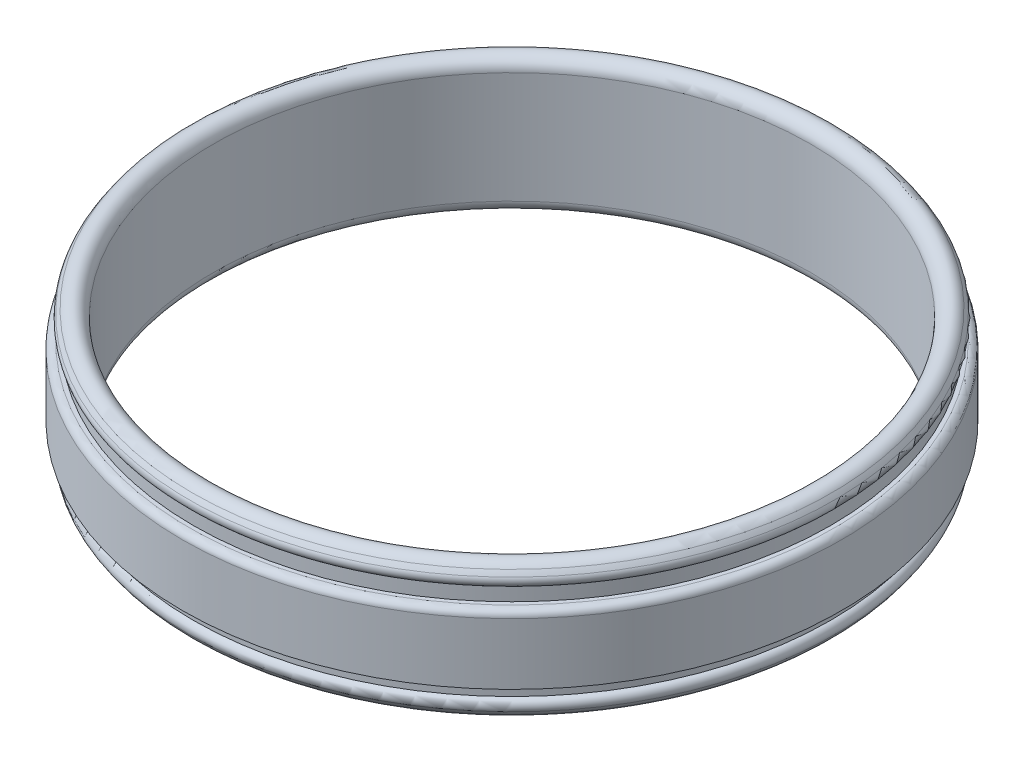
ISO-10303-21;
HEADER;
FILE_DESCRIPTION(('STEP AP214'),'2;1');
FILE_NAME('part.step','',(''),(''),'','','');
FILE_SCHEMA(('AUTOMOTIVE_DESIGN { 1 0 10303 214 1 1 1 1 }'));
ENDSEC;
DATA;
#1=APPLICATION_CONTEXT('core data for automotive mechanical design processes');
#2=APPLICATION_PROTOCOL_DEFINITION('international standard','automotive_design',2000,#1);
#3=PRODUCT_CONTEXT('',#1,'mechanical');
#4=PRODUCT('Part','Part','',(#3));
#5=PRODUCT_RELATED_PRODUCT_CATEGORY('part','',(#4));
#6=PRODUCT_DEFINITION_FORMATION('','',#4);
#7=PRODUCT_DEFINITION_CONTEXT('part definition',#1,'design');
#8=PRODUCT_DEFINITION('design','',#6,#7);
#9=PRODUCT_DEFINITION_SHAPE('','',#8);
#10=(LENGTH_UNIT() NAMED_UNIT(*) SI_UNIT(.MILLI.,.METRE.));
#11=(NAMED_UNIT(*) PLANE_ANGLE_UNIT() SI_UNIT($,.RADIAN.));
#12=(NAMED_UNIT(*) SI_UNIT($,.STERADIAN.) SOLID_ANGLE_UNIT());
#13=UNCERTAINTY_MEASURE_WITH_UNIT(LENGTH_MEASURE(1.E-05),#10,'distance_accuracy_value','');
#14=(GEOMETRIC_REPRESENTATION_CONTEXT(3) GLOBAL_UNCERTAINTY_ASSIGNED_CONTEXT((#13)) GLOBAL_UNIT_ASSIGNED_CONTEXT((#10,
#11,#12)) REPRESENTATION_CONTEXT('',''));
#15=CARTESIAN_POINT('',(0.,0.,0.));
#16=DIRECTION('',(0.,0.,1.));
#17=DIRECTION('',(1.,0.,0.));
#18=AXIS2_PLACEMENT_3D('',#15,#16,#17);
#19=CARTESIAN_POINT('',(0.,0.,0.));
#20=DIRECTION('',(0.,-1.,0.));
#21=DIRECTION('',(0.,0.,-1.));
#22=AXIS2_PLACEMENT_3D('',#19,#20,#21);
#23=CYLINDRICAL_SURFACE('',#22,64.5905314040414);
#24=CARTESIAN_POINT('',(0.,28.7992816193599,0.));
#25=DIRECTION('',(0.,1.,0.));
#26=DIRECTION('',(0.,0.,1.));
#27=AXIS2_PLACEMENT_3D('',#24,#25,#26);
#28=CIRCLE('',#27,64.5905314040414);
#29=CARTESIAN_POINT('',(0.,28.7992816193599,64.5905314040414));
#30=VERTEX_POINT('',#29);
#31=EDGE_CURVE('E56',#30,#30,#28,.T.);
#32=ORIENTED_EDGE('',*,*,#31,.T.);
#33=EDGE_LOOP('',(#32));
#34=FACE_BOUND('',#33,.T.);
#35=CARTESIAN_POINT('',(0.,4.76055773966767,0.));
#36=DIRECTION('',(0.,1.,0.));
#37=DIRECTION('',(0.,0.,1.));
#38=AXIS2_PLACEMENT_3D('',#35,#36,#37);
#39=CIRCLE('',#38,64.5905314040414);
#40=CARTESIAN_POINT('',(0.,4.76055773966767,64.5905314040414));
#41=VERTEX_POINT('',#40);
#42=EDGE_CURVE('E59',#41,#41,#39,.F.);
#43=ORIENTED_EDGE('',*,*,#42,.T.);
#44=EDGE_LOOP('',(#43));
#45=FACE_BOUND('',#44,.T.);
#46=ADVANCED_FACE('F33',(#34,#45),#23,.F.);
#47=CARTESIAN_POINT('',(0.,0.,0.));
#48=DIRECTION('',(0.,-1.,0.));
#49=DIRECTION('',(0.,0.,-1.));
#50=AXIS2_PLACEMENT_3D('',#47,#48,#49);
#51=CYLINDRICAL_SURFACE('',#50,71.2052243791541);
#52=CARTESIAN_POINT('',(0.,22.6502858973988,0.));
#53=DIRECTION('',(0.,-1.,0.));
#54=DIRECTION('',(0.,0.,-1.));
#55=AXIS2_PLACEMENT_3D('',#52,#53,#54);
#56=CIRCLE('',#55,71.2052243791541);
#57=CARTESIAN_POINT('',(0.,22.6502858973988,-71.2052243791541));
#58=VERTEX_POINT('',#57);
#59=EDGE_CURVE('E40',#58,#58,#56,.T.);
#60=ORIENTED_EDGE('',*,*,#59,.T.);
#61=EDGE_LOOP('',(#60));
#62=FACE_BOUND('',#61,.T.);
#63=CARTESIAN_POINT('',(0.,9.4095534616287,0.));
#64=DIRECTION('',(0.,1.,0.));
#65=DIRECTION('',(0.,0.,1.));
#66=AXIS2_PLACEMENT_3D('',#63,#64,#65);
#67=CIRCLE('',#66,71.2052243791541);
#68=CARTESIAN_POINT('',(0.,9.4095534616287,71.2052243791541));
#69=VERTEX_POINT('',#68);
#70=EDGE_CURVE('E71',#69,#69,#67,.F.);
#71=ORIENTED_EDGE('',*,*,#70,.F.);
#72=EDGE_LOOP('',(#71));
#73=FACE_BOUND('',#72,.T.);
#74=ADVANCED_FACE('F99',(#62,#73),#51,.T.);
#75=CARTESIAN_POINT('',(0.,9.4095534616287,0.));
#76=DIRECTION('',(0.,-1.,0.));
#77=DIRECTION('',(0.,0.,-1.));
#78=AXIS2_PLACEMENT_3D('',#75,#76,#77);
#79=TOROIDAL_SURFACE('',#78,61.2052243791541,10.);
#80=CARTESIAN_POINT('',(0.,4.18047288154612,0.));
#81=DIRECTION('',(0.,1.,0.));
#82=DIRECTION('',(0.,0.,1.));
#83=AXIS2_PLACEMENT_3D('',#80,#81,#82);
#84=CIRCLE('',#83,69.7291152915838);
#85=CARTESIAN_POINT('',(0.,4.18047288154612,69.7291152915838));
#86=VERTEX_POINT('',#85);
#87=EDGE_CURVE('E48',#86,#86,#84,.F.);
#88=ORIENTED_EDGE('',*,*,#87,.T.);
#89=EDGE_LOOP('',(#88));
#90=FACE_BOUND('',#89,.T.);
#91=CARTESIAN_POINT('',(0.,3.21089249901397,0.));
#92=DIRECTION('',(0.,1.,0.));
#93=DIRECTION('',(0.,0.,1.));
#94=AXIS2_PLACEMENT_3D('',#91,#92,#93);
#95=CIRCLE('',#94,69.0523004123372);
#96=CARTESIAN_POINT('',(0.,3.21089249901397,69.0523004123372));
#97=VERTEX_POINT('',#96);
#98=EDGE_CURVE('E53',#97,#97,#95,.T.);
#99=ORIENTED_EDGE('',*,*,#98,.T.);
#100=EDGE_LOOP('',(#99));
#101=FACE_BOUND('',#100,.T.);
#102=ADVANCED_FACE('F105',(#90,#101),#79,.T.);
#103=CARTESIAN_POINT('',(0.,24.1502858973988,0.));
#104=DIRECTION('',(0.,1.,0.));
#105=DIRECTION('',(0.,0.,1.));
#106=AXIS2_PLACEMENT_3D('',#103,#104,#105);
#107=TOROIDAL_SURFACE('',#106,61.2052243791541,10.);
#108=CARTESIAN_POINT('',(0.,29.3793664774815,0.));
#109=DIRECTION('',(0.,-1.,0.));
#110=DIRECTION('',(0.,0.,-1.));
#111=AXIS2_PLACEMENT_3D('',#108,#109,#110);
#112=CIRCLE('',#111,69.7291152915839);
#113=CARTESIAN_POINT('',(0.,29.3793664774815,-69.7291152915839));
#114=VERTEX_POINT('',#113);
#115=EDGE_CURVE('E10',#114,#114,#112,.F.);
#116=ORIENTED_EDGE('',*,*,#115,.T.);
#117=EDGE_LOOP('',(#116));
#118=FACE_BOUND('',#117,.T.);
#119=CARTESIAN_POINT('',(0.,30.3489468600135,0.));
#120=DIRECTION('',(0.,-1.,0.));
#121=DIRECTION('',(0.,0.,-1.));
#122=AXIS2_PLACEMENT_3D('',#119,#120,#121);
#123=CIRCLE('',#122,69.0523004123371);
#124=CARTESIAN_POINT('',(0.,30.3489468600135,-69.0523004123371));
#125=VERTEX_POINT('',#124);
#126=EDGE_CURVE('E62',#125,#125,#123,.T.);
#127=ORIENTED_EDGE('',*,*,#126,.T.);
#128=EDGE_LOOP('',(#127));
#129=FACE_BOUND('',#128,.T.);
#130=ADVANCED_FACE('F112',(#118,#129),#107,.T.);
#131=CARTESIAN_POINT('',(0.,28.7992816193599,0.));
#132=DIRECTION('',(0.,1.,0.));
#133=DIRECTION('',(0.,0.,1.));
#134=AXIS2_PLACEMENT_3D('',#131,#132,#133);
#135=TOROIDAL_SURFACE('',#134,67.0905314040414,2.5);
#136=ORIENTED_EDGE('',*,*,#31,.F.);
#137=EDGE_LOOP('',(#136));
#138=FACE_BOUND('',#137,.T.);
#139=ORIENTED_EDGE('',*,*,#126,.F.);
#140=EDGE_LOOP('',(#139));
#141=FACE_BOUND('',#140,.T.);
#142=ADVANCED_FACE('F116',(#138,#141),#135,.T.);
#143=CARTESIAN_POINT('',(0.,4.76055773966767,0.));
#144=DIRECTION('',(0.,1.,0.));
#145=DIRECTION('',(0.,0.,1.));
#146=AXIS2_PLACEMENT_3D('',#143,#144,#145);
#147=TOROIDAL_SURFACE('',#146,67.0905314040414,2.5);
#148=ORIENTED_EDGE('',*,*,#98,.F.);
#149=EDGE_LOOP('',(#148));
#150=FACE_BOUND('',#149,.T.);
#151=ORIENTED_EDGE('',*,*,#42,.F.);
#152=EDGE_LOOP('',(#151));
#153=FACE_BOUND('',#152,.T.);
#154=ADVANCED_FACE('F119',(#150,#153),#147,.T.);
#155=CARTESIAN_POINT('',(0.,0.,0.));
#156=DIRECTION('',(0.,-1.,0.));
#157=DIRECTION('',(0.,0.,-1.));
#158=AXIS2_PLACEMENT_3D('',#155,#156,#157);
#159=CYLINDRICAL_SURFACE('',#158,68.8540021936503);
#160=CARTESIAN_POINT('',(0.,24.1502858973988,0.));
#161=DIRECTION('',(0.,-1.,0.));
#162=DIRECTION('',(0.,0.,-1.));
#163=AXIS2_PLACEMENT_3D('',#160,#161,#162);
#164=CIRCLE('',#163,68.8540021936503);
#165=CARTESIAN_POINT('',(0.,24.1502858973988,-68.8540021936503));
#166=VERTEX_POINT('',#165);
#167=EDGE_CURVE('E68',#166,#166,#164,.T.);
#168=ORIENTED_EDGE('',*,*,#167,.F.);
#169=EDGE_LOOP('',(#168));
#170=FACE_BOUND('',#169,.T.);
#171=CARTESIAN_POINT('',(0.,27.1502858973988,0.));
#172=DIRECTION('',(0.,-1.,0.));
#173=DIRECTION('',(0.,0.,-1.));
#174=AXIS2_PLACEMENT_3D('',#171,#172,#173);
#175=CIRCLE('',#174,68.8540021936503);
#176=CARTESIAN_POINT('',(0.,27.1502858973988,-68.8540021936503));
#177=VERTEX_POINT('',#176);
#178=EDGE_CURVE('E65',#177,#177,#175,.T.);
#179=ORIENTED_EDGE('',*,*,#178,.T.);
#180=EDGE_LOOP('',(#179));
#181=FACE_BOUND('',#180,.T.);
#182=ADVANCED_FACE('F122',(#170,#181),#159,.T.);
#183=CARTESIAN_POINT('',(68.8540021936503,24.1502858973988,0.));
#184=DIRECTION('',(0.,-1.,0.));
#185=DIRECTION('',(0.,0.,-1.));
#186=AXIS2_PLACEMENT_3D('',#183,#184,#185);
#187=PLANE('',#186);
#188=CARTESIAN_POINT('',(0.,24.1502858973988,0.));
#189=DIRECTION('',(0.,-1.,0.));
#190=DIRECTION('',(0.,0.,-1.));
#191=AXIS2_PLACEMENT_3D('',#188,#189,#190);
#192=CIRCLE('',#191,69.7052243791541);
#193=CARTESIAN_POINT('',(0.,24.1502858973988,-69.7052243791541));
#194=VERTEX_POINT('',#193);
#195=EDGE_CURVE('E44',#194,#194,#192,.F.);
#196=ORIENTED_EDGE('',*,*,#195,.T.);
#197=EDGE_LOOP('',(#196));
#198=FACE_BOUND('',#197,.T.);
#199=ORIENTED_EDGE('',*,*,#167,.T.);
#200=EDGE_LOOP('',(#199));
#201=FACE_BOUND('',#200,.T.);
#202=ADVANCED_FACE('F95',(#198,#201),#187,.F.);
#203=CARTESIAN_POINT('',(0.,0.,0.));
#204=DIRECTION('',(0.,-1.,0.));
#205=DIRECTION('',(0.,0.,-1.));
#206=AXIS2_PLACEMENT_3D('',#203,#204,#205);
#207=CYLINDRICAL_SURFACE('',#206,68.8540021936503);
#208=CARTESIAN_POINT('',(0.,6.4095534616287,0.));
#209=DIRECTION('',(0.,-1.,0.));
#210=DIRECTION('',(0.,0.,-1.));
#211=AXIS2_PLACEMENT_3D('',#208,#209,#210);
#212=CIRCLE('',#211,68.8540021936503);
#213=CARTESIAN_POINT('',(0.,6.4095534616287,-68.8540021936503));
#214=VERTEX_POINT('',#213);
#215=EDGE_CURVE('E74',#214,#214,#212,.T.);
#216=ORIENTED_EDGE('',*,*,#215,.F.);
#217=EDGE_LOOP('',(#216));
#218=FACE_BOUND('',#217,.T.);
#219=CARTESIAN_POINT('',(0.,9.4095534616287,0.));
#220=DIRECTION('',(0.,-1.,0.));
#221=DIRECTION('',(0.,0.,-1.));
#222=AXIS2_PLACEMENT_3D('',#219,#220,#221);
#223=CIRCLE('',#222,68.8540021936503);
#224=CARTESIAN_POINT('',(0.,9.4095534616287,-68.8540021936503));
#225=VERTEX_POINT('',#224);
#226=EDGE_CURVE('E77',#225,#225,#223,.T.);
#227=ORIENTED_EDGE('',*,*,#226,.T.);
#228=EDGE_LOOP('',(#227));
#229=FACE_BOUND('',#228,.T.);
#230=ADVANCED_FACE('F81',(#218,#229),#207,.T.);
#231=CARTESIAN_POINT('',(68.8540021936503,9.4095534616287,0.));
#232=DIRECTION('',(0.,1.,0.));
#233=DIRECTION('',(0.,0.,1.));
#234=AXIS2_PLACEMENT_3D('',#231,#232,#233);
#235=PLANE('',#234);
#236=ORIENTED_EDGE('',*,*,#70,.T.);
#237=EDGE_LOOP('',(#236));
#238=FACE_BOUND('',#237,.T.);
#239=ORIENTED_EDGE('',*,*,#226,.F.);
#240=EDGE_LOOP('',(#239));
#241=FACE_BOUND('',#240,.T.);
#242=ADVANCED_FACE('F83',(#238,#241),#235,.F.);
#243=CARTESIAN_POINT('',(0.,4.96483496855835,0.));
#244=DIRECTION('',(0.,-1.,0.));
#245=DIRECTION('',(0.,0.,-1.));
#246=AXIS2_PLACEMENT_3D('',#243,#244,#245);
#247=TOROIDAL_SURFACE('',#246,68.4505316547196,1.5);
#248=ORIENTED_EDGE('',*,*,#87,.F.);
#249=EDGE_LOOP('',(#248));
#250=FACE_BOUND('',#249,.T.);
#251=ORIENTED_EDGE('',*,*,#215,.T.);
#252=EDGE_LOOP('',(#251));
#253=FACE_BOUND('',#252,.T.);
#254=ADVANCED_FACE('F85',(#250,#253),#247,.T.);
#255=CARTESIAN_POINT('',(0.,22.6502858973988,0.));
#256=DIRECTION('',(0.,-1.,0.));
#257=DIRECTION('',(0.,0.,-1.));
#258=AXIS2_PLACEMENT_3D('',#255,#256,#257);
#259=TOROIDAL_SURFACE('',#258,69.7052243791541,1.5);
#260=ORIENTED_EDGE('',*,*,#59,.F.);
#261=EDGE_LOOP('',(#260));
#262=FACE_BOUND('',#261,.T.);
#263=ORIENTED_EDGE('',*,*,#195,.F.);
#264=EDGE_LOOP('',(#263));
#265=FACE_BOUND('',#264,.T.);
#266=ADVANCED_FACE('F92',(#262,#265),#259,.T.);
#267=CARTESIAN_POINT('',(0.,28.5950043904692,0.));
#268=DIRECTION('',(0.,1.,0.));
#269=DIRECTION('',(0.,0.,1.));
#270=AXIS2_PLACEMENT_3D('',#267,#268,#269);
#271=TOROIDAL_SURFACE('',#270,68.4505316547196,1.5);
#272=ORIENTED_EDGE('',*,*,#115,.F.);
#273=EDGE_LOOP('',(#272));
#274=FACE_BOUND('',#273,.T.);
#275=ORIENTED_EDGE('',*,*,#178,.F.);
#276=EDGE_LOOP('',(#275));
#277=FACE_BOUND('',#276,.T.);
#278=ADVANCED_FACE('F35',(#274,#277),#271,.T.);
#279=CLOSED_SHELL('',(#46,#74,#102,#130,#142,#154,#182,#202,#230,#242,#254,#266,#278));
#280=MANIFOLD_SOLID_BREP('B2',#279);
#281=ADVANCED_BREP_SHAPE_REPRESENTATION('',(#18,#280),#14);
#282=SHAPE_DEFINITION_REPRESENTATION(#9,#281);
ENDSEC;
END-ISO-10303-21;
